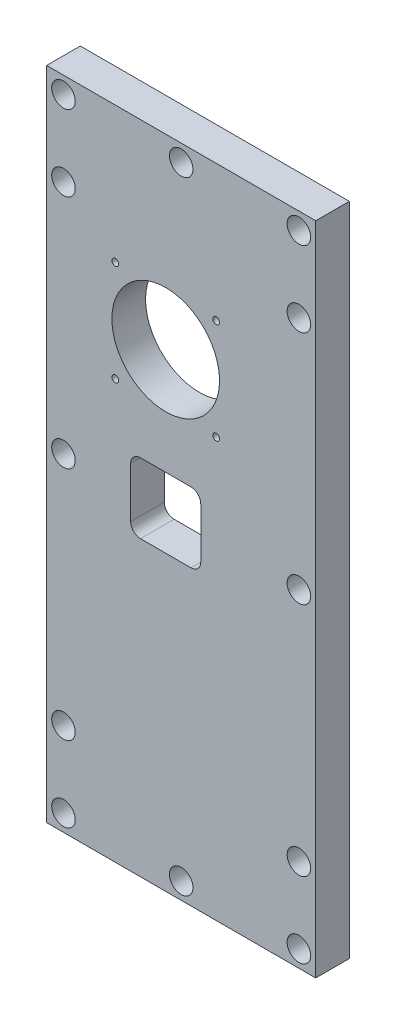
from build123d import *

# Parameters (mm, degrees)
SKIZZE1_W                       = 80
SKIZZE1_H                       = 195
AUFSATZ_LINEAR_AUSTRAGEN1_DEPTH = 10
SKIZZE2_R                       = 1
SKIZZE2_R_2                     = 16
SCHNITT_LINEAR_AUSTRAGEN1_DEPTH = 10
SKIZZE3_R                       = 1.7
SCHNITT_LINEAR_AUSTRAGEN2_DEPTH = 5
SKIZZE4_R                       = 3.5
SCHNITT_LINEAR_AUSTRAGEN3_DEPTH = 5


with BuildPart() as part:
    # Skizze1 → Aufsatz-Linear austragen1 (new body)
    with BuildSketch(Plane.XY):
        with Locations((-29.059385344, -27.400468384)):
            Rectangle(SKIZZE1_W, SKIZZE1_H)
    extrude(amount=-AUFSATZ_LINEAR_AUSTRAGEN1_DEPTH)

    # Skizze2 → Schnitt-Linear austragen1 (cut)
    with BuildSketch(Plane(origin=(0, 0, -10), x_dir=(-1, 0, 0), z_dir=(0, 0, -1))):
        with Locations((18.659385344, 29.599531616)):
            Circle(SKIZZE2_R)
        with Locations((48.659385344, 29.599531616)):
            Circle(SKIZZE2_R)
        with Locations((18.659385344, -0.400468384)):
            Circle(SKIZZE2_R)
        with Locations((48.659385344, -0.400468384)):
            Circle(SKIZZE2_R)
        with Locations((33.659385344, 14.599531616)):
            Circle(SKIZZE2_R_2)
        with BuildLine():
            Line((23.241327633, -19.900468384), (23.241327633, -34.900468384))
            ThreePointArc((23.241327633, -34.900468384), (24.096006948, -36.96384678), (26.159385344, -37.818526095))
            Line((26.159385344, -37.818526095), (41.159385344, -37.818526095))
            ThreePointArc((41.159385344, -37.818526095), (43.22276374, -36.96384678), (44.077443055, -34.900468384))
            Line((44.077443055, -34.900468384), (44.077443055, -19.900468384))
            ThreePointArc((44.077443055, -19.900468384), (43.22276374, -17.837089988), (41.159385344, -16.982410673))
            Line((41.159385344, -16.982410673), (26.159385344, -16.982410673))
            ThreePointArc((26.159385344, -16.982410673), (24.096006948, -17.837089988), (23.241327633, -19.900468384))
        make_face()
    extrude(amount=-SCHNITT_LINEAR_AUSTRAGEN1_DEPTH, mode=Mode.SUBTRACT)

    # Skizze3 → Schnitt-Linear austragen2 (cut)
    with BuildSketch(Plane(origin=(0, 0, -10), x_dir=(-1, 0, 0), z_dir=(0, 0, -1))):
        with Locations((-5.940614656, 65.099531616)):
            Circle(SKIZZE3_R)
        with Locations((64.059385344, 65.099531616)):
            Circle(SKIZZE3_R)
        with Locations((29.059385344, 65.099531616)):
            Circle(SKIZZE3_R)
        with Locations((64.059385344, 42.599531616)):
            Circle(SKIZZE3_R)
        with Locations((64.059385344, -27.400468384)):
            Circle(SKIZZE3_R)
        with Locations((64.059385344, -97.400468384)):
            Circle(SKIZZE3_R)
        with Locations((64.059385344, -119.900468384)):
            Circle(SKIZZE3_R)
        with Locations((29.059385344, -119.900468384)):
            Circle(SKIZZE3_R)
        with Locations((-5.940614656, -119.900468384)):
            Circle(SKIZZE3_R)
        with Locations((-5.940614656, -97.400468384)):
            Circle(SKIZZE3_R)
        with Locations((-5.940614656, -27.400468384)):
            Circle(SKIZZE3_R)
        with Locations((-5.940614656, 42.599531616)):
            Circle(SKIZZE3_R)
    extrude(amount=-SCHNITT_LINEAR_AUSTRAGEN2_DEPTH, mode=Mode.SUBTRACT)

    # Skizze4 → Schnitt-Linear austragen3 (cut)
    with BuildSketch(Plane.XY):
        with Locations((-64.059385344, 65.099531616)):
            Circle(SKIZZE4_R)
        with Locations((5.940614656, 65.099531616)):
            Circle(SKIZZE4_R)
        with Locations((5.940614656, 42.599531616)):
            Circle(SKIZZE4_R)
        with Locations((5.940614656, -27.400468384)):
            Circle(SKIZZE4_R)
        with Locations((5.940614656, -97.400468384)):
            Circle(SKIZZE4_R)
        with Locations((5.940614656, -119.900468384)):
            Circle(SKIZZE4_R)
        with Locations((-64.059385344, -119.900468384)):
            Circle(SKIZZE4_R)
        with Locations((-64.059385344, -97.400468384)):
            Circle(SKIZZE4_R)
        with Locations((-64.059385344, -27.400468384)):
            Circle(SKIZZE4_R)
        with Locations((-64.059385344, 42.599531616)):
            Circle(SKIZZE4_R)
        with Locations((-29.059385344, -119.900468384)):
            Circle(SKIZZE4_R)
        with Locations((-29.059385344, 65.099531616)):
            Circle(SKIZZE4_R)
    extrude(amount=-SCHNITT_LINEAR_AUSTRAGEN3_DEPTH, mode=Mode.SUBTRACT)


solid = part.part
